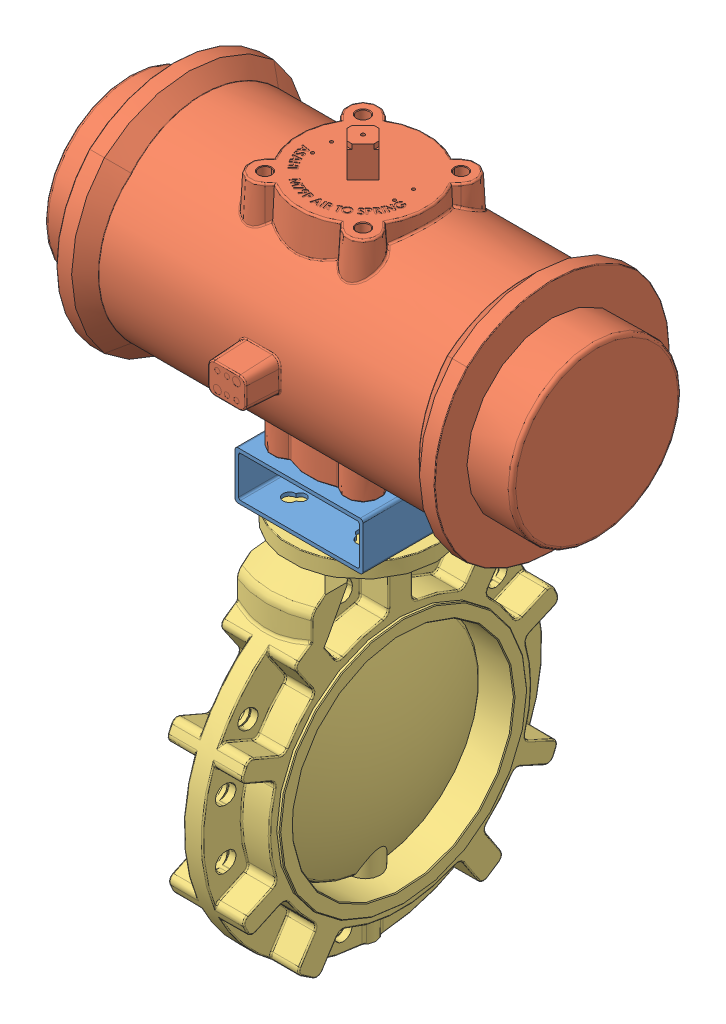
SolidWorks assembly T57BF_14IN_AS.SLDASM, configuration Default (file format 3800). Lengths in mm.
Overall size (742.5 1099.45 540).
3 component instances, 3 part files, 9 mates.
Components (placement in the parent):
- 14_16_AS-BKT-1: 14_16_AS-BKT.SLDPRT [Default] at origin size (203.2 76.2 203.2)
- M79P_AIR_SPR-1: M79P_AIR_SPR.SLDPRT [Default] at (101.6 267.2 -101.6) size (742.5 428 402.5)
- T57BF_14-1: T57BF_14.SLDPRT [Default] at (101.6 -325 -101.6) x (0 0 1) z (-1 0 0) size (540 722.25 235)
Mates (geometry in assembly coordinates):
- Coincident1: coincident aligned: plane of 14_16_AS-BKT-1 through (0 0 0) normal (0 0 1)
- Coincident2: coincident aligned: unknown of 14_16_AS-BKT-1
- Coincident3: coincident aligned: unknown of 14_16_AS-BKT-1
- Concentric2: concentric aligned: cylinder of 14_16_AS-BKT-1; circle of M79P_AIR_SPR-1
- Coincident6: coincident anti-aligned: plane of 14_16_AS-BKT-1 through (0 76.2 -203.2) normal (0 1 0); plane of M79P_AIR_SPR-1 through (53.6445 76.2 -32.0922) normal (0 -1 0)
- Parallel3: parallel aligned: plane of 14_16_AS-BKT-1 through (203.2 76.2 -203.2) normal (1 0 0); plane of M79P_AIR_SPR-1 through (472.85 267.2 -101.6) normal (1 0 0)
- Concentric3: concentric aligned: circle of 14_16_AS-BKT-1; cylinder of T57BF_14-1
- Coincident9: coincident: line of 14_16_AS-BKT-1; plane of T57BF_14-1 through (101.6 0 -101.6) normal (0 1 0)
- Parallel4: parallel aligned: plane of M79P_AIR_SPR-1 through (472.85 267.2 -101.6) normal (1 0 0); plane of T57BF_14-1 through (116.6 -325 -101.6) normal (1 0 0)
